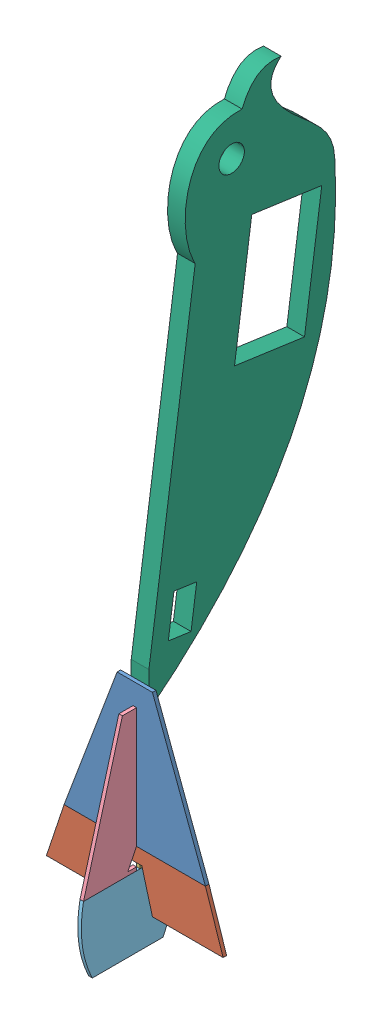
SolidWorks assembly Assem1.SLDASM, configuration Default (file format 12000). Lengths in mm.
Overall size (100 410.9 160.37).
6 component instances, 6 part files, 18 mates.
Components (placement in the parent):
- Part2-1: Part2.SLDPRT [Default] at (63.7868 94.9767 60.8986) size (80 80 2)
- Part3-1: Part3.SLDPRT [Default] at (50.7663 14.9767 60.8986) size (100 30 2)
- Part5-1: Part5.SLDPRT [Default] at (60.8943 51.4661 60.8986) x (0 -1 0) z (1 0 0) size (80 18 2)
- Part4-2: Part4.SLDPRT [Default] at (62.8943 51.4661 62.8986) x (0 -1 0) z (-1 0 0) size (80 30 2)
- Part6-1: Part6.SLDPRT [Default] at (60.8943 2.9767 62.187) x (0 0 1) z (1 0 0) size (53.98 40 2)
- Part1-1: Part1.SLDPRT [Default] at (62.8943 204.1716 19.1777) x (0 0.990216 -0.139542) z (1 0 0) size (291.28 104.28 10)
Mates (geometry in assembly coordinates):
- Coincident1: coincident aligned: plane of Part2-1 through (63.7868 94.9767 62.8986) normal (0 0 1); plane of Part3-1 through (50.7663 14.9767 62.8986) normal (0 0 1)
- Coincident2: coincident anti-aligned: plane of Part2-1 through (101.8943 14.9767 62.8986) normal (0 -1 0); plane of Part3-1 through (50.7663 14.9767 62.8986) normal (0 1 0)
- Coincident3: coincident aligned: line of Part2-1 through (101.8943 14.9767 62.8986) axis (0 0 -1); line of Part3-1 through (101.8943 14.9767 62.8986) axis (0 0 -1)
- Coincident10: coincident anti-aligned: plane of Part3-1 through (50.7663 14.9767 60.8986) normal (0 0 -1); plane of Part4-1 through (62.8943 51.4661 60.8986) normal (0 0 1)
- Parallel3: parallel anti-aligned: plane of Part3-1 through (50.7663 6.9767 62.8986) normal (0 -1 0); plane of Part4-1 through (62.8943 4.9767 60.8986) normal (0 1 0)
- Coincident12: coincident anti-aligned: plane of Part2-1 through (63.7868 94.9767 62.8986) normal (0 0 1); plane of Part4-2 through (60.8943 51.4661 62.8986) normal (0 0 -1)
- Parallel4: parallel anti-aligned: plane of Part3-1 through (50.7663 6.9767 62.8986) normal (0 -1 0); plane of Part4-2 through (60.8943 4.9767 62.8986) normal (0 1 0)
- Parallel5: parallel anti-aligned: plane of Part5-1 through (62.8943 51.4661 60.8986) normal (0 0 1); plane of Part4-2 through (60.8943 51.4661 62.8986) normal (0 0 -1)
- Coincident17: coincident anti-aligned: plane of Part4-2 through (60.8943 2.9767 62.8986) normal (0 -1 0); plane of Part6-1 through (62.8943 2.9767 42.8986) normal (0 1 0)
- Coincident18: coincident anti-aligned: line of Part4-2 through (60.8943 2.9767 92.8986) axis (1 0 0); line of Part6-1 through (62.8943 2.9767 92.8986) axis (-1 0 0)
- Coincident19: coincident aligned: plane of Part4-2 through (60.8943 51.4661 62.8986) normal (-1 0 0); plane of Part6-1 through (60.8943 -17.7918 42.1597) normal (-1 0 0)
- Distance3: distance = 3 mm: plane of Part4-2 through (60.8943 51.4661 62.8986) normal (-1 0 0); line of Part3-1 through (57.8943 6.9767 62.8986) axis (0 0 -1)
- Coincident23: coincident aligned: plane of Part5-1 through (60.8943 51.4661 60.8986) normal (-1 0 0); plane of Part6-1 through (60.8943 -17.7918 42.1597) normal (-1 0 0)
- Coincident27: coincident anti-aligned: plane of Part5-1 through (62.8943 2.9767 60.8986) normal (0 -1 0); plane of Part6-1 through (62.8943 2.9767 42.8986) normal (0 1 0)
- Distance4: distance = 12 mm aligned: plane of Part5-1 through (62.8943 82.9767 60.8986) normal (0 1 0); plane of Part2-1 through (51.8943 94.9767 62.8986) normal (0 1 0)
- Coincident29: coincident: plane of Part2-1 through (63.7868 94.9767 60.8986) normal (0 0 -1); plane of Part1-1 through (72.9496 82.9767 60.8986) normal (0 0 1)
- Coincident30: coincident: line of Part5-1 through (62.8943 82.9767 60.8986) axis (-1 0 0); line of Part1-1 through (72.9496 82.9767 60.8986) axis (-1 0 0)
- Distance5: distance = 6 mm: plane of Part1-1 through (57.8943 363.9483 -0.8334) normal (-1 0 0); line of Part2-1 through (51.8943 94.9767 62.8986) axis (0 0 -1)
